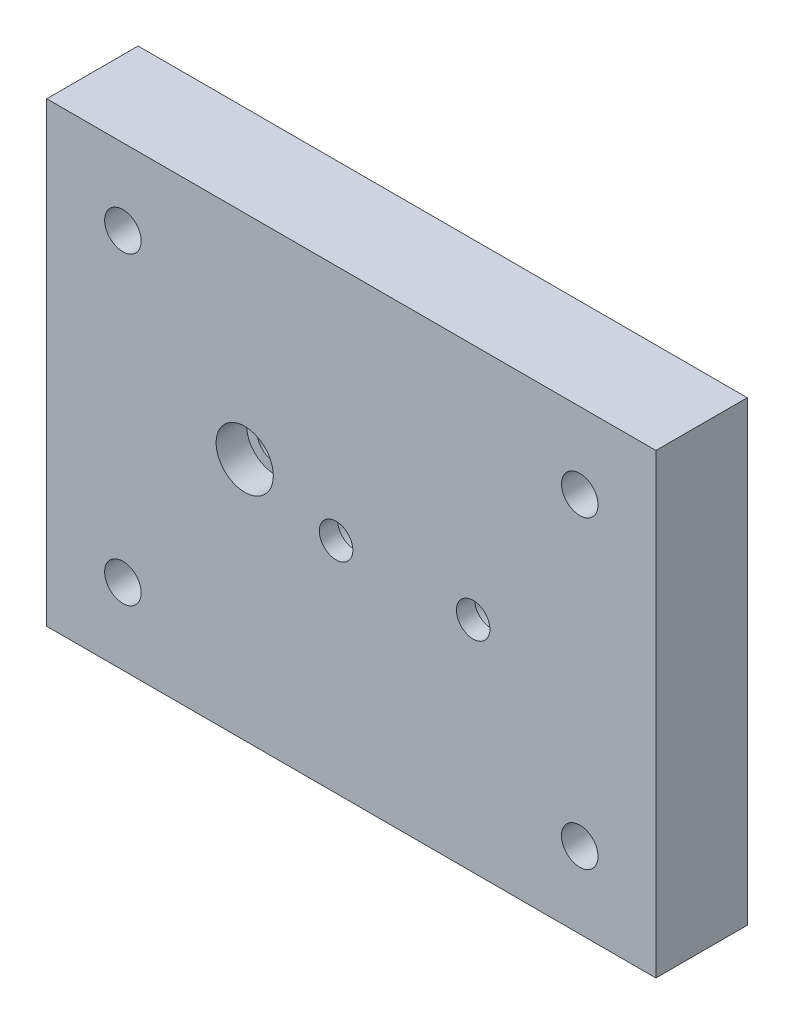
from build123d import *

# Parameters (mm, degrees)
ESQUISSE1_W              = 200
ESQUISSE1_H              = 150
BASE_EXTRUSION_DEPTH     = 30
ESQUISSE2_R              = 9.39
ENL_V_MAT_EXTRU_1_DEPTH  = 10
ESQUISSE3_R              = 6
ENL_V_MAT_EXTRU_2_DEPTH  = 7
ESQUISSE10_R             = 9
ENL_V_MAT_EXTRU_9_DEPTH  = 251.577333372
ESQUISSE11_R             = 5.5
ENL_V_MAT_EXTRU_10_DEPTH = 6
ESQUISSE12_R             = 10
ENL_V_MAT_EXTRU_11_DEPTH = 252.149357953
ESQUISSE8_R              = 6
ENL_V_MAT_EXTRU_7_DEPTH  = 18
ESQUISSE9_R              = 9
ENL_V_MAT_EXTRU_8_DEPTH  = 251.647162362


with BuildPart() as part:
    # Esquisse1 → Base-Extrusion (new body)
    with BuildSketch(Plane.XY):
        with Locations((100, 75)):
            Rectangle(ESQUISSE1_W, ESQUISSE1_H)
    extrude(amount=BASE_EXTRUSION_DEPTH)

    # Esquisse2 → Enl_v. mat.-Extru.1 (cut)
    with BuildSketch(Plane.XY.offset(30)):
        with Locations((65, 80)):
            Circle(ESQUISSE2_R)
    extrude(amount=-ENL_V_MAT_EXTRU_1_DEPTH, mode=Mode.SUBTRACT)

    # Esquisse3 → Enl_v. mat.-Extru.2 (cut)
    with BuildSketch(Plane.XY.offset(20)):
        with Locations((65, 80)):
            Circle(ESQUISSE3_R)
    extrude(amount=-ENL_V_MAT_EXTRU_2_DEPTH, mode=Mode.SUBTRACT)

    # Esquisse10 → Enl_v. mat.-Extru.9 (cut, through all)
    with BuildSketch(Plane.XY.offset(13)):
        with Locations((65, 80)):
            Circle(ESQUISSE10_R)
    extrude(amount=-ENL_V_MAT_EXTRU_9_DEPTH, mode=Mode.SUBTRACT)

    # Esquisse11 → Enl_v. mat.-Extru.10 (cut)
    with BuildSketch(Plane.XY.offset(30)):
        with Locations((95, 71.88)):
            Circle(ESQUISSE11_R)
        with Locations((140, 71.88)):
            Circle(ESQUISSE11_R)
    extrude(amount=-ENL_V_MAT_EXTRU_10_DEPTH, mode=Mode.SUBTRACT)

    # Esquisse12 → Enl_v. mat.-Extru.11 (cut, through all)
    with BuildSketch(Plane.XY.offset(24)):
        with Locations((140, 71.88)):
            Circle(ESQUISSE12_R)
        with Locations((95, 71.88)):
            Circle(ESQUISSE12_R)
    extrude(amount=-ENL_V_MAT_EXTRU_11_DEPTH, mode=Mode.SUBTRACT)

    # Esquisse8 → Enl_v. mat.-Extru.7 (cut)
    with BuildSketch(Plane.XY.offset(30)):
        with Locations((25, 125)):
            Circle(ESQUISSE8_R)
        with Locations((25, 25)):
            Circle(ESQUISSE8_R)
        with Locations((175, 25)):
            Circle(ESQUISSE8_R)
        with Locations((175, 125)):
            Circle(ESQUISSE8_R)
    extrude(amount=-ENL_V_MAT_EXTRU_7_DEPTH, mode=Mode.SUBTRACT)

    # Esquisse9 → Enl_v. mat.-Extru.8 (cut, through all)
    with BuildSketch(Plane.XY.offset(12)):
        with Locations((25, 125)):
            Circle(ESQUISSE9_R)
        with Locations((175, 125)):
            Circle(ESQUISSE9_R)
        with Locations((175, 25)):
            Circle(ESQUISSE9_R)
        with Locations((25, 25)):
            Circle(ESQUISSE9_R)
    extrude(amount=-ENL_V_MAT_EXTRU_8_DEPTH, mode=Mode.SUBTRACT)


solid = part.part
